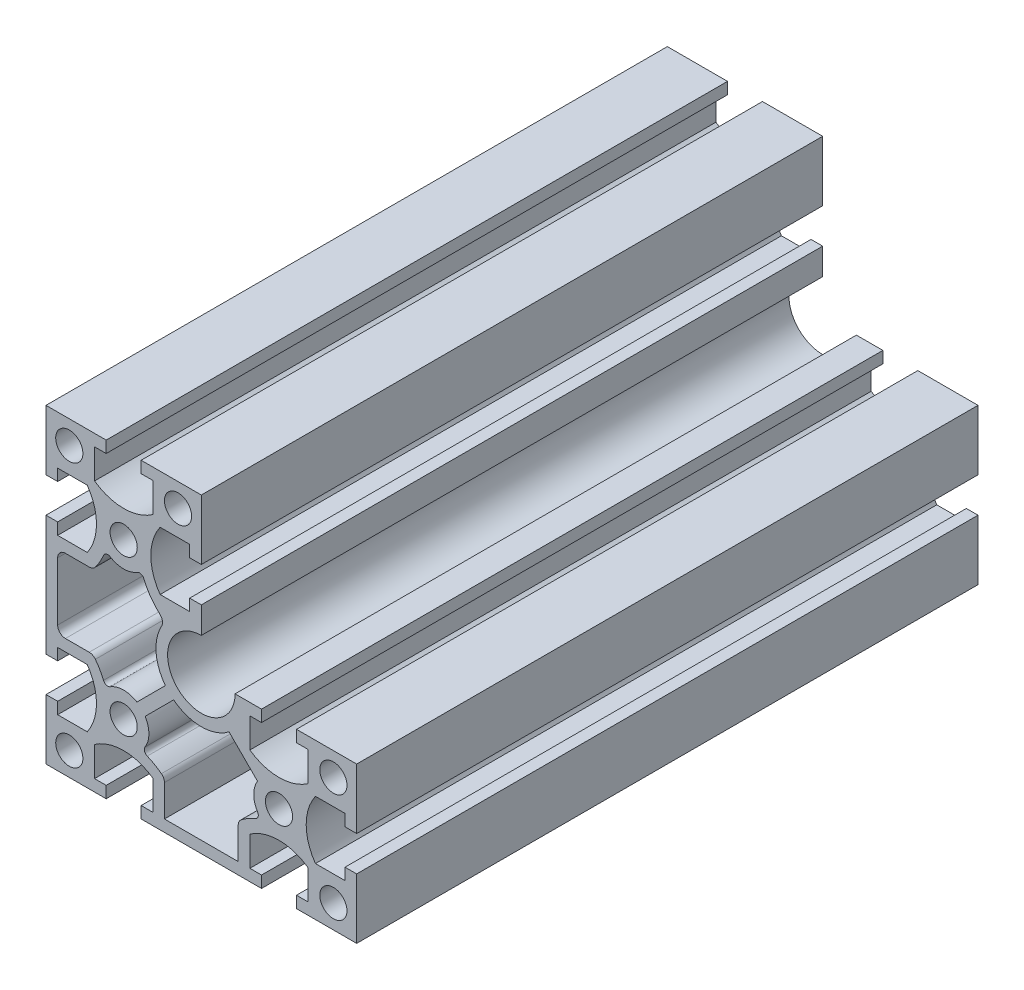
from build123d import *

# Parameters (mm, degrees)
SKETCH_1_R      = 1.75
EXTRUDE_1_DEPTH = 40


with BuildPart() as part:
    # Sketch 1 → Extrude 1 (new, symmetric)
    with BuildSketch(Plane.XY):
        with BuildLine():
            Line((0, 20), (-7.75, 20))
            Line((-7.75, 20), (-7.75, 18.5))
            Line((-7.75, 18.5), (-6.25, 18.5))
            Line((-6.25, 18.5), (-6.25, 14.690809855))
            ThreePointArc((-6.25, 14.690809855), (-10, 13.5), (-13.75, 14.690809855))
            Line((-13.75, 14.690809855), (-13.75, 18.5))
            Line((-13.75, 18.5), (-12.25, 18.5))
            Line((-12.25, 18.5), (-12.25, 20))
            Line((-12.25, 20), (-20, 20))
            Line((-20, 20), (-20, 12.25))
            Line((-20, 12.25), (-18.5, 12.25))
            Line((-18.5, 12.25), (-18.5, 13.75))
            Line((-18.5, 13.75), (-14.690809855, 13.75))
            ThreePointArc((-14.690809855, 13.75), (-13.5, 10), (-14.690809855, 6.25))
            Line((-14.690809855, 6.25), (-18.5, 6.25))
            Line((-18.5, 6.25), (-18.5, 7.75))
            Line((-18.5, 7.75), (-20, 7.75))
            Line((-20, 7.75), (-20, -7.75))
            Line((-20, -7.75), (-18.5, -7.75))
            Line((-18.5, -7.75), (-18.5, -6.25))
            Line((-18.5, -6.25), (-14.690809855, -6.25))
            ThreePointArc((-14.690809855, -6.25), (-13.5, -10), (-14.690809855, -13.75))
            Line((-14.690809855, -13.75), (-18.5, -13.75))
            Line((-18.5, -13.75), (-18.5, -12.25))
            Line((-18.5, -12.25), (-20, -12.25))
            Line((-20, -12.25), (-20, -20))
            Line((-20, -20), (-12.25, -20))
            Line((-12.25, -20), (-12.25, -18.5))
            Line((-12.25, -18.5), (-13.75, -18.5))
            Line((-13.75, -18.5), (-13.75, -14.690809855))
            ThreePointArc((-13.75, -14.690809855), (-10, -13.5), (-6.25, -14.690809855))
            Line((-6.25, -14.690809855), (-6.25, -18.5))
            Line((-6.25, -18.5), (-7.75, -18.5))
            Line((-7.75, -18.5), (-7.75, -20))
            Line((-7.75, -20), (7.75, -20))
            Line((7.75, -20), (7.75, -18.5))
            Line((7.75, -18.5), (6.25, -18.5))
            Line((6.25, -18.5), (6.25, -14.690809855))
            ThreePointArc((6.25, -14.690809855), (10, -13.5), (13.75, -14.690809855))
            Line((13.75, -14.690809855), (13.75, -18.5))
            Line((13.75, -18.5), (12.25, -18.5))
            Line((12.25, -18.5), (12.25, -20))
            Line((12.25, -20), (20, -20))
            Line((20, -20), (20, -12.25))
            Line((20, -12.25), (18.5, -12.25))
            Line((18.5, -12.25), (18.5, -13.75))
            Line((18.5, -13.75), (14.690809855, -13.75))
            ThreePointArc((14.690809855, -13.75), (13.5, -10), (14.690809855, -6.25))
            Line((14.690809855, -6.25), (18.5, -6.25))
            Line((18.5, -6.25), (18.5, -7.75))
            Line((18.5, -7.75), (20, -7.75))
            Line((20, -7.75), (20, 0))
            Line((20, 0), (12.25, 0))
            Line((12.25, 0), (12.25, -1.5))
            Line((12.25, -1.5), (13.75, -1.5))
            Line((13.75, -1.5), (13.75, -5.309190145))
            ThreePointArc((13.75, -5.309190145), (10, -6.5), (6.25, -5.309190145))
            Line((6.25, -5.309190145), (6.25, -1.5))
            Line((6.25, -1.5), (7.75, -1.5))
            Line((7.75, -1.5), (7.75, 0))
            Line((7.75, 0), (4.343677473, 0))
            ThreePointArc((4.343677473, 0), (-3.071443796, -3.071443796), (0, 4.343677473))
            Line((0, 4.343677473), (0, 7.75))
            Line((0, 7.75), (-1.5, 7.75))
            Line((-1.5, 7.75), (-1.5, 6.25))
            Line((-1.5, 6.25), (-5.309190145, 6.25))
            ThreePointArc((-5.309190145, 6.25), (-6.5, 10), (-5.309190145, 13.75))
            Line((-5.309190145, 13.75), (-1.5, 13.75))
            Line((-1.5, 13.75), (-1.5, 12.25))
            Line((-1.5, 12.25), (0, 12.25))
            Line((0, 12.25), (0, 20))
        make_face()
        with Locations((-10, 10)):
            Circle(SKETCH_1_R, mode=Mode.SUBTRACT)
        with Locations((-17, 17)):
            Circle(SKETCH_1_R, mode=Mode.SUBTRACT)
        with Locations(Location((-3, 17, 0), (0, 0, 180))):
            Circle(SKETCH_1_R, mode=Mode.SUBTRACT)
        with Locations(Location((-17, -17, 0), (0, 0, 180))):
            Circle(SKETCH_1_R, mode=Mode.SUBTRACT)
        with Locations(Location((-10, -10, 0), (0, 0, 180))):
            Circle(SKETCH_1_R, mode=Mode.SUBTRACT)
        with Locations((10, -10)):
            Circle(SKETCH_1_R, mode=Mode.SUBTRACT)
        with Locations(Location((17, -3, 0), (0, 0, 180))):
            Circle(SKETCH_1_R, mode=Mode.SUBTRACT)
        with Locations((17, -17)):
            Circle(SKETCH_1_R, mode=Mode.SUBTRACT)
        with BuildLine():
            Line((-18.5, -3.75), (-18.5, 3.75))
            ThreePointArc((-18.5, 3.75), (-18.207106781, 4.457106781), (-17.5, 4.75))
            Line((-17.5, 4.75), (-14.437851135, 4.75))
            ThreePointArc((-14.437851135, 4.75), (-13.994648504, 4.853578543), (-13.64325844, 5.142857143))
            ThreePointArc((-13.64325844, 5.142857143), (-13.060721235, 6.019245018), (-12.598255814, 6.964512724))
            ThreePointArc((-12.598255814, 6.964512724), (-12.226790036, 7.308049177), (-11.724715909, 7.245393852))
            ThreePointArc((-11.724715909, 7.245393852), (-10, 6.75), (-8.275284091, 7.245393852))
            ThreePointArc((-8.275284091, 7.245393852), (-7.773209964, 7.308049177), (-7.401744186, 6.964512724))
            ThreePointArc((-7.401744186, 6.964512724), (-6.533598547, 5.383498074), (-5.333333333, 4.03715206))
            ThreePointArc((-5.333333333, 4.03715206), (-5.01435404, 3.460621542), (-5.12327838, 2.810797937))
            ThreePointArc((-5.12327838, 2.810797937), (-5.826158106, -0.45215941), (-4.628260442, -3.56760027))
            Line((-4.628260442, -3.56760027), (-8.294262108, -7.233601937))
            ThreePointArc((-8.294262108, -7.233601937), (-10.011171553, -6.750019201), (-11.724715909, -7.245393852))
            ThreePointArc((-11.724715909, -7.245393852), (-12.226790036, -7.308049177), (-12.598255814, -6.964512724))
            ThreePointArc((-12.598255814, -6.964512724), (-13.060721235, -6.019245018), (-13.64325844, -5.142857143))
            ThreePointArc((-13.64325844, -5.142857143), (-13.994648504, -4.853578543), (-14.437851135, -4.75))
            Line((-14.437851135, -4.75), (-17.5, -4.75))
            ThreePointArc((-17.5, -4.75), (-18.207106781, -4.457106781), (-18.5, -3.75))
        make_face(mode=Mode.SUBTRACT)
        with BuildLine():
            Line((-4.75, -18.5), (-4.75, -14.437851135))
            ThreePointArc((-4.75, -14.437851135), (-4.853578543, -13.994648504), (-5.142857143, -13.64325844))
            ThreePointArc((-5.142857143, -13.64325844), (-6.019245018, -13.060721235), (-6.964512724, -12.598255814))
            ThreePointArc((-6.964512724, -12.598255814), (-7.308049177, -12.226790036), (-7.245393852, -11.724715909))
            ThreePointArc((-7.245393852, -11.724715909), (-6.750019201, -10.011171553), (-7.233601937, -8.294262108))
            Line((-7.233601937, -8.294262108), (-3.56760027, -4.628260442))
            ThreePointArc((-3.56760027, -4.628260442), (0, -5.843677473), (3.56760027, -4.628260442))
            Line((3.56760027, -4.628260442), (7.233601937, -8.294262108))
            ThreePointArc((7.233601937, -8.294262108), (6.750019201, -10.011171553), (7.245393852, -11.724715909))
            ThreePointArc((7.245393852, -11.724715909), (7.308049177, -12.226790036), (6.964512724, -12.598255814))
            ThreePointArc((6.964512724, -12.598255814), (6.019245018, -13.060721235), (5.142857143, -13.64325844))
            ThreePointArc((5.142857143, -13.64325844), (4.853578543, -13.994648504), (4.75, -14.437851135))
            Line((4.75, -14.437851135), (4.75, -18.5))
            Line((4.75, -18.5), (-4.75, -18.5))
        make_face(mode=Mode.SUBTRACT)
    extrude(amount=EXTRUDE_1_DEPTH, both=True)


solid = part.part
